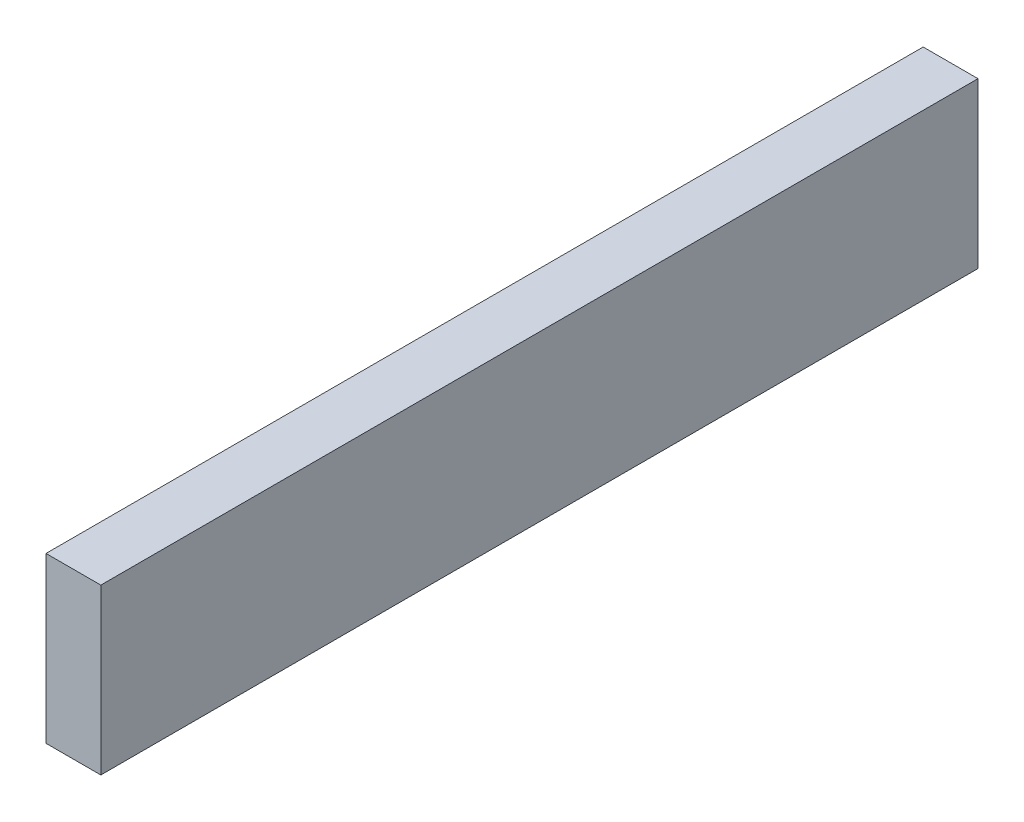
ISO-10303-21;
HEADER;
FILE_DESCRIPTION(('STEP AP214'),'2;1');
FILE_NAME('part.step','',(''),(''),'','','');
FILE_SCHEMA(('AUTOMOTIVE_DESIGN { 1 0 10303 214 1 1 1 1 }'));
ENDSEC;
DATA;
#1=APPLICATION_CONTEXT('core data for automotive mechanical design processes');
#2=APPLICATION_PROTOCOL_DEFINITION('international standard','automotive_design',2000,#1);
#3=PRODUCT_CONTEXT('',#1,'mechanical');
#4=PRODUCT('Part','Part','',(#3));
#5=PRODUCT_RELATED_PRODUCT_CATEGORY('part','',(#4));
#6=PRODUCT_DEFINITION_FORMATION('','',#4);
#7=PRODUCT_DEFINITION_CONTEXT('part definition',#1,'design');
#8=PRODUCT_DEFINITION('design','',#6,#7);
#9=PRODUCT_DEFINITION_SHAPE('','',#8);
#10=(LENGTH_UNIT() NAMED_UNIT(*) SI_UNIT(.MILLI.,.METRE.));
#11=(NAMED_UNIT(*) PLANE_ANGLE_UNIT() SI_UNIT($,.RADIAN.));
#12=(NAMED_UNIT(*) SI_UNIT($,.STERADIAN.) SOLID_ANGLE_UNIT());
#13=UNCERTAINTY_MEASURE_WITH_UNIT(LENGTH_MEASURE(1.E-05),#10,'distance_accuracy_value','');
#14=(GEOMETRIC_REPRESENTATION_CONTEXT(3) GLOBAL_UNCERTAINTY_ASSIGNED_CONTEXT((#13)) GLOBAL_UNIT_ASSIGNED_CONTEXT((#10,
#11,#12)) REPRESENTATION_CONTEXT('',''));
#15=CARTESIAN_POINT('',(0.,0.,0.));
#16=DIRECTION('',(0.,0.,1.));
#17=DIRECTION('',(1.,0.,0.));
#18=AXIS2_PLACEMENT_3D('',#15,#16,#17);
#19=CARTESIAN_POINT('',(12.7,-38.1,-203.2));
#20=DIRECTION('',(1.,0.,0.));
#21=DIRECTION('',(0.,0.,-1.));
#22=AXIS2_PLACEMENT_3D('',#19,#20,#21);
#23=PLANE('',#22);
#24=DIRECTION('',(0.,1.,0.));
#25=VECTOR('',#24,1.);
#26=CARTESIAN_POINT('',(12.7,-38.1,203.2));
#27=LINE('',#26,#25);
#28=CARTESIAN_POINT('',(12.7,-38.1,203.2));
#29=VERTEX_POINT('',#28);
#30=CARTESIAN_POINT('',(12.7,38.1,203.2));
#31=VERTEX_POINT('',#30);
#32=EDGE_CURVE('E101',#29,#31,#27,.T.);
#33=ORIENTED_EDGE('',*,*,#32,.F.);
#34=DIRECTION('',(0.,0.,1.));
#35=VECTOR('',#34,1.);
#36=CARTESIAN_POINT('',(12.7,-38.1,-203.2));
#37=LINE('',#36,#35);
#38=CARTESIAN_POINT('',(12.7,-38.1,-203.2));
#39=VERTEX_POINT('',#38);
#40=EDGE_CURVE('E11',#39,#29,#37,.T.);
#41=ORIENTED_EDGE('',*,*,#40,.F.);
#42=DIRECTION('',(0.,1.,0.));
#43=VECTOR('',#42,1.);
#44=CARTESIAN_POINT('',(12.7,-38.1,-203.2));
#45=LINE('',#44,#43);
#46=CARTESIAN_POINT('',(12.7,38.1,-203.2));
#47=VERTEX_POINT('',#46);
#48=EDGE_CURVE('E95',#39,#47,#45,.T.);
#49=ORIENTED_EDGE('',*,*,#48,.T.);
#50=DIRECTION('',(0.,0.,1.));
#51=VECTOR('',#50,1.);
#52=CARTESIAN_POINT('',(12.7,38.1,-203.2));
#53=LINE('',#52,#51);
#54=EDGE_CURVE('E40',#47,#31,#53,.T.);
#55=ORIENTED_EDGE('',*,*,#54,.T.);
#56=EDGE_LOOP('',(#33,#41,#49,#55));
#57=FACE_BOUND('',#56,.T.);
#58=ADVANCED_FACE('F37',(#57),#23,.T.);
#59=CARTESIAN_POINT('',(-12.7,-38.1,-203.2));
#60=DIRECTION('',(0.,-1.,0.));
#61=DIRECTION('',(0.,0.,-1.));
#62=AXIS2_PLACEMENT_3D('',#59,#60,#61);
#63=PLANE('',#62);
#64=DIRECTION('',(1.,0.,0.));
#65=VECTOR('',#64,1.);
#66=CARTESIAN_POINT('',(-12.7,-38.1,203.2));
#67=LINE('',#66,#65);
#68=CARTESIAN_POINT('',(-12.7,-38.1,203.2));
#69=VERTEX_POINT('',#68);
#70=EDGE_CURVE('E97',#69,#29,#67,.T.);
#71=ORIENTED_EDGE('',*,*,#70,.F.);
#72=DIRECTION('',(0.,0.,1.));
#73=VECTOR('',#72,1.);
#74=CARTESIAN_POINT('',(-12.7,-38.1,-203.2));
#75=LINE('',#74,#73);
#76=CARTESIAN_POINT('',(-12.7,-38.1,-203.2));
#77=VERTEX_POINT('',#76);
#78=EDGE_CURVE('E46',#77,#69,#75,.T.);
#79=ORIENTED_EDGE('',*,*,#78,.F.);
#80=DIRECTION('',(1.,0.,0.));
#81=VECTOR('',#80,1.);
#82=CARTESIAN_POINT('',(-12.7,-38.1,-203.2));
#83=LINE('',#82,#81);
#84=EDGE_CURVE('E92',#77,#39,#83,.T.);
#85=ORIENTED_EDGE('',*,*,#84,.T.);
#86=ORIENTED_EDGE('',*,*,#40,.T.);
#87=EDGE_LOOP('',(#71,#79,#85,#86));
#88=FACE_BOUND('',#87,.T.);
#89=ADVANCED_FACE('F111',(#88),#63,.T.);
#90=CARTESIAN_POINT('',(-12.7,-38.1,-203.2));
#91=DIRECTION('',(-1.,0.,0.));
#92=DIRECTION('',(0.,0.,1.));
#93=AXIS2_PLACEMENT_3D('',#90,#91,#92);
#94=PLANE('',#93);
#95=DIRECTION('',(0.,-1.,0.));
#96=VECTOR('',#95,1.);
#97=CARTESIAN_POINT('',(-12.7,-38.1,203.2));
#98=LINE('',#97,#96);
#99=CARTESIAN_POINT('',(-12.7,38.1,203.2));
#100=VERTEX_POINT('',#99);
#101=EDGE_CURVE('E87',#100,#69,#98,.T.);
#102=ORIENTED_EDGE('',*,*,#101,.F.);
#103=DIRECTION('',(0.,0.,1.));
#104=VECTOR('',#103,1.);
#105=CARTESIAN_POINT('',(-12.7,38.1,-203.2));
#106=LINE('',#105,#104);
#107=CARTESIAN_POINT('',(-12.7,38.1,-203.2));
#108=VERTEX_POINT('',#107);
#109=EDGE_CURVE('E82',#108,#100,#106,.T.);
#110=ORIENTED_EDGE('',*,*,#109,.F.);
#111=DIRECTION('',(0.,-1.,0.));
#112=VECTOR('',#111,1.);
#113=CARTESIAN_POINT('',(-12.7,-38.1,-203.2));
#114=LINE('',#113,#112);
#115=EDGE_CURVE('E85',#108,#77,#114,.T.);
#116=ORIENTED_EDGE('',*,*,#115,.T.);
#117=ORIENTED_EDGE('',*,*,#78,.T.);
#118=EDGE_LOOP('',(#102,#110,#116,#117));
#119=FACE_BOUND('',#118,.T.);
#120=ADVANCED_FACE('F84',(#119),#94,.T.);
#121=CARTESIAN_POINT('',(-12.7,38.1,-203.2));
#122=DIRECTION('',(0.,1.,0.));
#123=DIRECTION('',(0.,0.,1.));
#124=AXIS2_PLACEMENT_3D('',#121,#122,#123);
#125=PLANE('',#124);
#126=DIRECTION('',(-1.,0.,0.));
#127=VECTOR('',#126,1.);
#128=CARTESIAN_POINT('',(-12.7,38.1,203.2));
#129=LINE('',#128,#127);
#130=EDGE_CURVE('E104',#31,#100,#129,.T.);
#131=ORIENTED_EDGE('',*,*,#130,.F.);
#132=ORIENTED_EDGE('',*,*,#54,.F.);
#133=DIRECTION('',(-1.,0.,0.));
#134=VECTOR('',#133,1.);
#135=CARTESIAN_POINT('',(-12.7,38.1,-203.2));
#136=LINE('',#135,#134);
#137=EDGE_CURVE('E91',#47,#108,#136,.T.);
#138=ORIENTED_EDGE('',*,*,#137,.T.);
#139=ORIENTED_EDGE('',*,*,#109,.T.);
#140=EDGE_LOOP('',(#131,#132,#138,#139));
#141=FACE_BOUND('',#140,.T.);
#142=ADVANCED_FACE('F94',(#141),#125,.T.);
#143=CARTESIAN_POINT('',(0.,0.,-203.2));
#144=DIRECTION('',(0.,0.,-1.));
#145=DIRECTION('',(-1.,0.,0.));
#146=AXIS2_PLACEMENT_3D('',#143,#144,#145);
#147=PLANE('',#146);
#148=ORIENTED_EDGE('',*,*,#48,.F.);
#149=ORIENTED_EDGE('',*,*,#84,.F.);
#150=ORIENTED_EDGE('',*,*,#115,.F.);
#151=ORIENTED_EDGE('',*,*,#137,.F.);
#152=EDGE_LOOP('',(#148,#149,#150,#151));
#153=FACE_BOUND('',#152,.T.);
#154=ADVANCED_FACE('F90',(#153),#147,.T.);
#155=CARTESIAN_POINT('',(0.,0.,203.2));
#156=DIRECTION('',(0.,0.,-1.));
#157=DIRECTION('',(-1.,0.,0.));
#158=AXIS2_PLACEMENT_3D('',#155,#156,#157);
#159=PLANE('',#158);
#160=ORIENTED_EDGE('',*,*,#32,.T.);
#161=ORIENTED_EDGE('',*,*,#130,.T.);
#162=ORIENTED_EDGE('',*,*,#101,.T.);
#163=ORIENTED_EDGE('',*,*,#70,.T.);
#164=EDGE_LOOP('',(#160,#161,#162,#163));
#165=FACE_BOUND('',#164,.T.);
#166=ADVANCED_FACE('F110',(#165),#159,.F.);
#167=CLOSED_SHELL('',(#58,#89,#120,#142,#154,#166));
#168=MANIFOLD_SOLID_BREP('B2',#167);
#169=ADVANCED_BREP_SHAPE_REPRESENTATION('',(#18,#168),#14);
#170=SHAPE_DEFINITION_REPRESENTATION(#9,#169);
ENDSEC;
END-ISO-10303-21;
